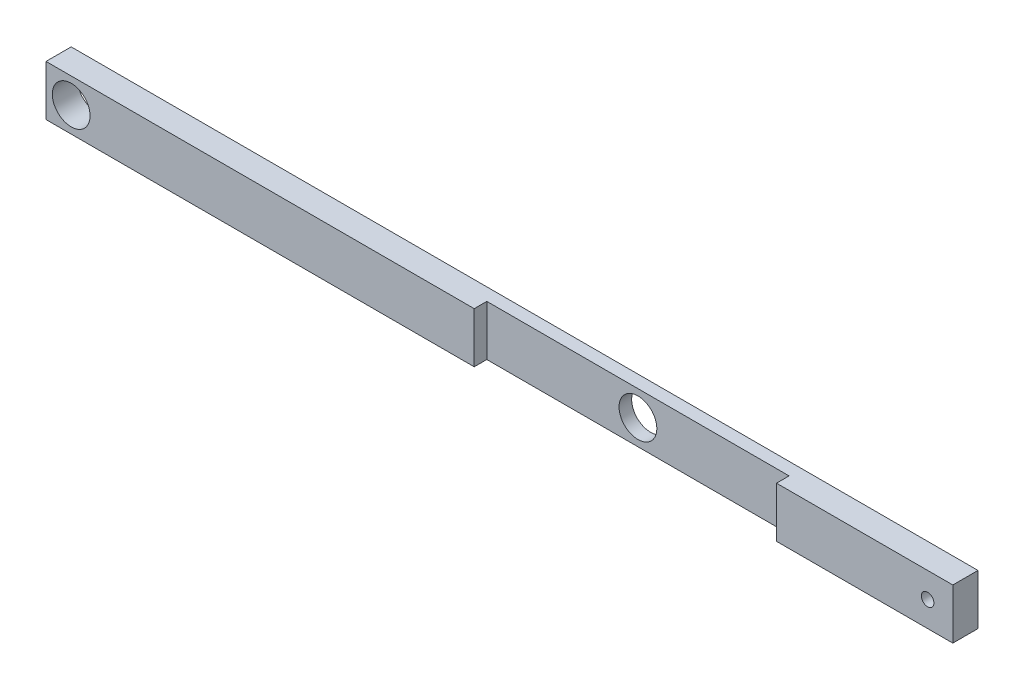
ISO-10303-21;
HEADER;
FILE_DESCRIPTION(('STEP AP214'),'2;1');
FILE_NAME('part.step','',(''),(''),'','','');
FILE_SCHEMA(('AUTOMOTIVE_DESIGN { 1 0 10303 214 1 1 1 1 }'));
ENDSEC;
DATA;
#1=APPLICATION_CONTEXT('core data for automotive mechanical design processes');
#2=APPLICATION_PROTOCOL_DEFINITION('international standard','automotive_design',2000,#1);
#3=PRODUCT_CONTEXT('',#1,'mechanical');
#4=PRODUCT('Part','Part','',(#3));
#5=PRODUCT_RELATED_PRODUCT_CATEGORY('part','',(#4));
#6=PRODUCT_DEFINITION_FORMATION('','',#4);
#7=PRODUCT_DEFINITION_CONTEXT('part definition',#1,'design');
#8=PRODUCT_DEFINITION('design','',#6,#7);
#9=PRODUCT_DEFINITION_SHAPE('','',#8);
#10=(LENGTH_UNIT() NAMED_UNIT(*) SI_UNIT(.MILLI.,.METRE.));
#11=(NAMED_UNIT(*) PLANE_ANGLE_UNIT() SI_UNIT($,.RADIAN.));
#12=(NAMED_UNIT(*) SI_UNIT($,.STERADIAN.) SOLID_ANGLE_UNIT());
#13=UNCERTAINTY_MEASURE_WITH_UNIT(LENGTH_MEASURE(1.E-05),#10,'distance_accuracy_value','');
#14=(GEOMETRIC_REPRESENTATION_CONTEXT(3) GLOBAL_UNCERTAINTY_ASSIGNED_CONTEXT((#13)) GLOBAL_UNIT_ASSIGNED_CONTEXT((#10,
#11,#12)) REPRESENTATION_CONTEXT('',''));
#15=CARTESIAN_POINT('',(0.,0.,0.));
#16=DIRECTION('',(0.,0.,1.));
#17=DIRECTION('',(1.,0.,0.));
#18=AXIS2_PLACEMENT_3D('',#15,#16,#17);
#19=CARTESIAN_POINT('',(0.,20.,10.));
#20=DIRECTION('',(0.,0.,-1.));
#21=DIRECTION('',(-1.,0.,0.));
#22=AXIS2_PLACEMENT_3D('',#19,#20,#21);
#23=PLANE('',#22);
#24=CARTESIAN_POINT('',(10.,10.,10.));
#25=DIRECTION('',(0.,0.,1.));
#26=DIRECTION('',(1.,0.,0.));
#27=AXIS2_PLACEMENT_3D('',#24,#25,#26);
#28=CIRCLE('',#27,7.5);
#29=CARTESIAN_POINT('',(17.5,10.,10.));
#30=VERTEX_POINT('',#29);
#31=EDGE_CURVE('E151',#30,#30,#28,.T.);
#32=ORIENTED_EDGE('',*,*,#31,.F.);
#33=EDGE_LOOP('',(#32));
#34=FACE_BOUND('',#33,.T.);
#35=DIRECTION('',(1.,0.,0.));
#36=VECTOR('',#35,1.);
#37=CARTESIAN_POINT('',(0.,0.,10.));
#38=LINE('',#37,#36);
#39=CARTESIAN_POINT('',(0.,0.,10.));
#40=VERTEX_POINT('',#39);
#41=CARTESIAN_POINT('',(170.,0.,10.));
#42=VERTEX_POINT('',#41);
#43=EDGE_CURVE('E87',#40,#42,#38,.T.);
#44=ORIENTED_EDGE('',*,*,#43,.T.);
#45=DIRECTION('',(0.,-1.,0.));
#46=VECTOR('',#45,1.);
#47=CARTESIAN_POINT('',(170.,0.,10.));
#48=LINE('',#47,#46);
#49=CARTESIAN_POINT('',(170.,20.,10.));
#50=VERTEX_POINT('',#49);
#51=EDGE_CURVE('E113',#50,#42,#48,.T.);
#52=ORIENTED_EDGE('',*,*,#51,.F.);
#53=DIRECTION('',(-1.,0.,0.));
#54=VECTOR('',#53,1.);
#55=CARTESIAN_POINT('',(0.,20.,10.));
#56=LINE('',#55,#54);
#57=CARTESIAN_POINT('',(0.,20.,10.));
#58=VERTEX_POINT('',#57);
#59=EDGE_CURVE('E58',#50,#58,#56,.T.);
#60=ORIENTED_EDGE('',*,*,#59,.T.);
#61=DIRECTION('',(0.,-1.,0.));
#62=VECTOR('',#61,1.);
#63=CARTESIAN_POINT('',(0.,0.,10.));
#64=LINE('',#63,#62);
#65=EDGE_CURVE('E158',#58,#40,#64,.T.);
#66=ORIENTED_EDGE('',*,*,#65,.T.);
#67=EDGE_LOOP('',(#44,#52,#60,#66));
#68=FACE_BOUND('',#67,.T.);
#69=ADVANCED_FACE('F33',(#34,#68),#23,.F.);
#70=CARTESIAN_POINT('',(0.,0.,10.));
#71=DIRECTION('',(1.,0.,0.));
#72=DIRECTION('',(0.,0.,-1.));
#73=AXIS2_PLACEMENT_3D('',#70,#71,#72);
#74=PLANE('',#73);
#75=DIRECTION('',(0.,-1.,0.));
#76=VECTOR('',#75,1.);
#77=CARTESIAN_POINT('',(0.,0.,0.));
#78=LINE('',#77,#76);
#79=CARTESIAN_POINT('',(0.,20.,0.));
#80=VERTEX_POINT('',#79);
#81=CARTESIAN_POINT('',(0.,0.,0.));
#82=VERTEX_POINT('',#81);
#83=EDGE_CURVE('E155',#80,#82,#78,.T.);
#84=ORIENTED_EDGE('',*,*,#83,.T.);
#85=DIRECTION('',(0.,0.,-1.));
#86=VECTOR('',#85,1.);
#87=CARTESIAN_POINT('',(0.,0.,10.));
#88=LINE('',#87,#86);
#89=EDGE_CURVE('E11',#40,#82,#88,.T.);
#90=ORIENTED_EDGE('',*,*,#89,.F.);
#91=ORIENTED_EDGE('',*,*,#65,.F.);
#92=DIRECTION('',(0.,0.,-1.));
#93=VECTOR('',#92,1.);
#94=CARTESIAN_POINT('',(0.,20.,10.));
#95=LINE('',#94,#93);
#96=EDGE_CURVE('E167',#58,#80,#95,.T.);
#97=ORIENTED_EDGE('',*,*,#96,.T.);
#98=EDGE_LOOP('',(#84,#90,#91,#97));
#99=FACE_BOUND('',#98,.T.);
#100=ADVANCED_FACE('F35',(#99),#74,.F.);
#101=CARTESIAN_POINT('',(0.,0.,10.));
#102=DIRECTION('',(0.,1.,0.));
#103=DIRECTION('',(0.,0.,1.));
#104=AXIS2_PLACEMENT_3D('',#101,#102,#103);
#105=PLANE('',#104);
#106=DIRECTION('',(1.,0.,0.));
#107=VECTOR('',#106,1.);
#108=CARTESIAN_POINT('',(170.,0.,5.));
#109=LINE('',#108,#107);
#110=CARTESIAN_POINT('',(170.,0.,5.));
#111=VERTEX_POINT('',#110);
#112=CARTESIAN_POINT('',(290.,0.,5.));
#113=VERTEX_POINT('',#112);
#114=EDGE_CURVE('E122',#111,#113,#109,.T.);
#115=ORIENTED_EDGE('',*,*,#114,.F.);
#116=DIRECTION('',(0.,0.,1.));
#117=VECTOR('',#116,1.);
#118=CARTESIAN_POINT('',(170.,0.,5.));
#119=LINE('',#118,#117);
#120=EDGE_CURVE('E108',#111,#42,#119,.T.);
#121=ORIENTED_EDGE('',*,*,#120,.T.);
#122=ORIENTED_EDGE('',*,*,#43,.F.);
#123=ORIENTED_EDGE('',*,*,#89,.T.);
#124=DIRECTION('',(1.,0.,0.));
#125=VECTOR('',#124,1.);
#126=CARTESIAN_POINT('',(0.,0.,0.));
#127=LINE('',#126,#125);
#128=CARTESIAN_POINT('',(360.,0.,0.));
#129=VERTEX_POINT('',#128);
#130=EDGE_CURVE('E170',#82,#129,#127,.T.);
#131=ORIENTED_EDGE('',*,*,#130,.T.);
#132=DIRECTION('',(0.,0.,-1.));
#133=VECTOR('',#132,1.);
#134=CARTESIAN_POINT('',(360.,0.,10.));
#135=LINE('',#134,#133);
#136=CARTESIAN_POINT('',(360.,0.,10.));
#137=VERTEX_POINT('',#136);
#138=EDGE_CURVE('E42',#137,#129,#135,.T.);
#139=ORIENTED_EDGE('',*,*,#138,.F.);
#140=CARTESIAN_POINT('',(290.,0.,10.));
#141=VERTEX_POINT('',#140);
#142=EDGE_CURVE('E160',#141,#137,#38,.T.);
#143=ORIENTED_EDGE('',*,*,#142,.F.);
#144=DIRECTION('',(0.,0.,1.));
#145=VECTOR('',#144,1.);
#146=CARTESIAN_POINT('',(290.,0.,5.));
#147=LINE('',#146,#145);
#148=EDGE_CURVE('E49',#113,#141,#147,.T.);
#149=ORIENTED_EDGE('',*,*,#148,.F.);
#150=EDGE_LOOP('',(#115,#121,#122,#123,#131,#139,#143,#149));
#151=FACE_BOUND('',#150,.T.);
#152=ADVANCED_FACE('F127',(#151),#105,.F.);
#153=CARTESIAN_POINT('',(360.,0.,10.));
#154=DIRECTION('',(-1.,0.,0.));
#155=DIRECTION('',(0.,0.,1.));
#156=AXIS2_PLACEMENT_3D('',#153,#154,#155);
#157=PLANE('',#156);
#158=DIRECTION('',(0.,1.,0.));
#159=VECTOR('',#158,1.);
#160=CARTESIAN_POINT('',(360.,0.,0.));
#161=LINE('',#160,#159);
#162=CARTESIAN_POINT('',(360.,20.,0.));
#163=VERTEX_POINT('',#162);
#164=EDGE_CURVE('E172',#129,#163,#161,.T.);
#165=ORIENTED_EDGE('',*,*,#164,.T.);
#166=DIRECTION('',(0.,0.,-1.));
#167=VECTOR('',#166,1.);
#168=CARTESIAN_POINT('',(360.,20.,10.));
#169=LINE('',#168,#167);
#170=CARTESIAN_POINT('',(360.,20.,10.));
#171=VERTEX_POINT('',#170);
#172=EDGE_CURVE('E176',#171,#163,#169,.T.);
#173=ORIENTED_EDGE('',*,*,#172,.F.);
#174=DIRECTION('',(0.,1.,0.));
#175=VECTOR('',#174,1.);
#176=CARTESIAN_POINT('',(360.,0.,10.));
#177=LINE('',#176,#175);
#178=EDGE_CURVE('E162',#137,#171,#177,.T.);
#179=ORIENTED_EDGE('',*,*,#178,.F.);
#180=ORIENTED_EDGE('',*,*,#138,.T.);
#181=EDGE_LOOP('',(#165,#173,#179,#180));
#182=FACE_BOUND('',#181,.T.);
#183=ADVANCED_FACE('F183',(#182),#157,.F.);
#184=CARTESIAN_POINT('',(0.,20.,10.));
#185=DIRECTION('',(0.,-1.,0.));
#186=DIRECTION('',(0.,0.,-1.));
#187=AXIS2_PLACEMENT_3D('',#184,#185,#186);
#188=PLANE('',#187);
#189=ORIENTED_EDGE('',*,*,#59,.F.);
#190=DIRECTION('',(0.,0.,1.));
#191=VECTOR('',#190,1.);
#192=CARTESIAN_POINT('',(170.,20.,5.));
#193=LINE('',#192,#191);
#194=CARTESIAN_POINT('',(170.,20.,5.));
#195=VERTEX_POINT('',#194);
#196=EDGE_CURVE('E136',#195,#50,#193,.T.);
#197=ORIENTED_EDGE('',*,*,#196,.F.);
#198=DIRECTION('',(-1.,0.,0.));
#199=VECTOR('',#198,1.);
#200=CARTESIAN_POINT('',(170.,20.,5.));
#201=LINE('',#200,#199);
#202=CARTESIAN_POINT('',(290.,20.,5.));
#203=VERTEX_POINT('',#202);
#204=EDGE_CURVE('E115',#203,#195,#201,.T.);
#205=ORIENTED_EDGE('',*,*,#204,.F.);
#206=DIRECTION('',(0.,0.,1.));
#207=VECTOR('',#206,1.);
#208=CARTESIAN_POINT('',(290.,20.,5.));
#209=LINE('',#208,#207);
#210=CARTESIAN_POINT('',(290.,20.,10.));
#211=VERTEX_POINT('',#210);
#212=EDGE_CURVE('E138',#203,#211,#209,.T.);
#213=ORIENTED_EDGE('',*,*,#212,.T.);
#214=EDGE_CURVE('E164',#171,#211,#56,.T.);
#215=ORIENTED_EDGE('',*,*,#214,.F.);
#216=ORIENTED_EDGE('',*,*,#172,.T.);
#217=DIRECTION('',(-1.,0.,0.));
#218=VECTOR('',#217,1.);
#219=CARTESIAN_POINT('',(0.,20.,0.));
#220=LINE('',#219,#218);
#221=EDGE_CURVE('E80',#163,#80,#220,.T.);
#222=ORIENTED_EDGE('',*,*,#221,.T.);
#223=ORIENTED_EDGE('',*,*,#96,.F.);
#224=EDGE_LOOP('',(#189,#197,#205,#213,#215,#216,#222,#223));
#225=FACE_BOUND('',#224,.T.);
#226=ADVANCED_FACE('F191',(#225),#188,.F.);
#227=CARTESIAN_POINT('',(350.,10.,10.));
#228=DIRECTION('',(0.,0.,1.));
#229=DIRECTION('',(1.,0.,0.));
#230=AXIS2_PLACEMENT_3D('',#227,#228,#229);
#231=CIRCLE('',#230,2.50000000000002);
#232=CARTESIAN_POINT('',(352.5,10.,10.));
#233=VERTEX_POINT('',#232);
#234=EDGE_CURVE('E146',#233,#233,#231,.T.);
#235=ORIENTED_EDGE('',*,*,#234,.F.);
#236=EDGE_LOOP('',(#235));
#237=FACE_BOUND('',#236,.T.);
#238=ORIENTED_EDGE('',*,*,#214,.T.);
#239=DIRECTION('',(0.,1.,0.));
#240=VECTOR('',#239,1.);
#241=CARTESIAN_POINT('',(290.,0.,10.));
#242=LINE('',#241,#240);
#243=EDGE_CURVE('E125',#141,#211,#242,.T.);
#244=ORIENTED_EDGE('',*,*,#243,.F.);
#245=ORIENTED_EDGE('',*,*,#142,.T.);
#246=ORIENTED_EDGE('',*,*,#178,.T.);
#247=EDGE_LOOP('',(#238,#244,#245,#246));
#248=FACE_BOUND('',#247,.T.);
#249=ADVANCED_FACE('F195',(#237,#248),#23,.F.);
#250=CARTESIAN_POINT('',(0.,20.,0.));
#251=DIRECTION('',(0.,0.,-1.));
#252=DIRECTION('',(-1.,0.,0.));
#253=AXIS2_PLACEMENT_3D('',#250,#251,#252);
#254=PLANE('',#253);
#255=CARTESIAN_POINT('',(350.,10.,0.));
#256=DIRECTION('',(0.,0.,1.));
#257=DIRECTION('',(1.,0.,0.));
#258=AXIS2_PLACEMENT_3D('',#255,#256,#257);
#259=CIRCLE('',#258,2.50000000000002);
#260=CARTESIAN_POINT('',(352.5,10.,0.));
#261=VERTEX_POINT('',#260);
#262=EDGE_CURVE('E142',#261,#261,#259,.T.);
#263=ORIENTED_EDGE('',*,*,#262,.T.);
#264=EDGE_LOOP('',(#263));
#265=FACE_BOUND('',#264,.T.);
#266=CARTESIAN_POINT('',(230.,10.,0.));
#267=DIRECTION('',(0.,0.,1.));
#268=DIRECTION('',(1.,0.,0.));
#269=AXIS2_PLACEMENT_3D('',#266,#267,#268);
#270=CIRCLE('',#269,7.50000000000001);
#271=CARTESIAN_POINT('',(237.5,10.,0.));
#272=VERTEX_POINT('',#271);
#273=EDGE_CURVE('E145',#272,#272,#270,.T.);
#274=ORIENTED_EDGE('',*,*,#273,.T.);
#275=EDGE_LOOP('',(#274));
#276=FACE_BOUND('',#275,.T.);
#277=CARTESIAN_POINT('',(10.,10.,0.));
#278=DIRECTION('',(0.,0.,1.));
#279=DIRECTION('',(1.,0.,0.));
#280=AXIS2_PLACEMENT_3D('',#277,#278,#279);
#281=CIRCLE('',#280,7.5);
#282=CARTESIAN_POINT('',(17.5,10.,0.));
#283=VERTEX_POINT('',#282);
#284=EDGE_CURVE('E152',#283,#283,#281,.T.);
#285=ORIENTED_EDGE('',*,*,#284,.T.);
#286=EDGE_LOOP('',(#285));
#287=FACE_BOUND('',#286,.T.);
#288=ORIENTED_EDGE('',*,*,#83,.F.);
#289=ORIENTED_EDGE('',*,*,#221,.F.);
#290=ORIENTED_EDGE('',*,*,#164,.F.);
#291=ORIENTED_EDGE('',*,*,#130,.F.);
#292=EDGE_LOOP('',(#288,#289,#290,#291));
#293=FACE_BOUND('',#292,.T.);
#294=ADVANCED_FACE('F187',(#265,#276,#287,#293),#254,.T.);
#295=CARTESIAN_POINT('',(10.,10.,0.));
#296=DIRECTION('',(0.,0.,1.));
#297=DIRECTION('',(1.,0.,0.));
#298=AXIS2_PLACEMENT_3D('',#295,#296,#297);
#299=CYLINDRICAL_SURFACE('',#298,7.5);
#300=ORIENTED_EDGE('',*,*,#284,.F.);
#301=EDGE_LOOP('',(#300));
#302=FACE_BOUND('',#301,.T.);
#303=ORIENTED_EDGE('',*,*,#31,.T.);
#304=EDGE_LOOP('',(#303));
#305=FACE_BOUND('',#304,.T.);
#306=ADVANCED_FACE('F208',(#302,#305),#299,.F.);
#307=CARTESIAN_POINT('',(230.,10.,0.));
#308=DIRECTION('',(0.,0.,1.));
#309=DIRECTION('',(1.,0.,0.));
#310=AXIS2_PLACEMENT_3D('',#307,#308,#309);
#311=CYLINDRICAL_SURFACE('',#310,7.50000000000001);
#312=CARTESIAN_POINT('',(230.,10.,5.));
#313=DIRECTION('',(0.,0.,-1.));
#314=DIRECTION('',(-1.,0.,0.));
#315=AXIS2_PLACEMENT_3D('',#312,#313,#314);
#316=CIRCLE('',#315,7.50000000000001);
#317=CARTESIAN_POINT('',(222.5,10.,5.));
#318=VERTEX_POINT('',#317);
#319=EDGE_CURVE('E37',#318,#318,#316,.F.);
#320=ORIENTED_EDGE('',*,*,#319,.T.);
#321=EDGE_LOOP('',(#320));
#322=FACE_BOUND('',#321,.T.);
#323=ORIENTED_EDGE('',*,*,#273,.F.);
#324=EDGE_LOOP('',(#323));
#325=FACE_BOUND('',#324,.T.);
#326=ADVANCED_FACE('F226',(#322,#325),#311,.F.);
#327=CARTESIAN_POINT('',(350.,10.,0.));
#328=DIRECTION('',(0.,0.,1.));
#329=DIRECTION('',(1.,0.,0.));
#330=AXIS2_PLACEMENT_3D('',#327,#328,#329);
#331=CYLINDRICAL_SURFACE('',#330,2.50000000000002);
#332=ORIENTED_EDGE('',*,*,#262,.F.);
#333=EDGE_LOOP('',(#332));
#334=FACE_BOUND('',#333,.T.);
#335=ORIENTED_EDGE('',*,*,#234,.T.);
#336=EDGE_LOOP('',(#335));
#337=FACE_BOUND('',#336,.T.);
#338=ADVANCED_FACE('F223',(#334,#337),#331,.F.);
#339=CARTESIAN_POINT('',(170.,20.,5.));
#340=DIRECTION('',(0.,0.,-1.));
#341=DIRECTION('',(-1.,0.,0.));
#342=AXIS2_PLACEMENT_3D('',#339,#340,#341);
#343=PLANE('',#342);
#344=DIRECTION('',(0.,-1.,0.));
#345=VECTOR('',#344,1.);
#346=CARTESIAN_POINT('',(170.,0.,5.));
#347=LINE('',#346,#345);
#348=EDGE_CURVE('E111',#195,#111,#347,.T.);
#349=ORIENTED_EDGE('',*,*,#348,.T.);
#350=ORIENTED_EDGE('',*,*,#114,.T.);
#351=DIRECTION('',(0.,1.,0.));
#352=VECTOR('',#351,1.);
#353=CARTESIAN_POINT('',(290.,0.,5.));
#354=LINE('',#353,#352);
#355=EDGE_CURVE('E129',#113,#203,#354,.T.);
#356=ORIENTED_EDGE('',*,*,#355,.T.);
#357=ORIENTED_EDGE('',*,*,#204,.T.);
#358=EDGE_LOOP('',(#349,#350,#356,#357));
#359=FACE_BOUND('',#358,.T.);
#360=ORIENTED_EDGE('',*,*,#319,.F.);
#361=EDGE_LOOP('',(#360));
#362=FACE_BOUND('',#361,.T.);
#363=ADVANCED_FACE('F119',(#359,#362),#343,.F.);
#364=CARTESIAN_POINT('',(170.,0.,5.));
#365=DIRECTION('',(-1.,0.,0.));
#366=DIRECTION('',(0.,0.,1.));
#367=AXIS2_PLACEMENT_3D('',#364,#365,#366);
#368=PLANE('',#367);
#369=ORIENTED_EDGE('',*,*,#51,.T.);
#370=ORIENTED_EDGE('',*,*,#120,.F.);
#371=ORIENTED_EDGE('',*,*,#348,.F.);
#372=ORIENTED_EDGE('',*,*,#196,.T.);
#373=EDGE_LOOP('',(#369,#370,#371,#372));
#374=FACE_BOUND('',#373,.T.);
#375=ADVANCED_FACE('F110',(#374),#368,.F.);
#376=CARTESIAN_POINT('',(290.,0.,5.));
#377=DIRECTION('',(1.,0.,0.));
#378=DIRECTION('',(0.,0.,-1.));
#379=AXIS2_PLACEMENT_3D('',#376,#377,#378);
#380=PLANE('',#379);
#381=ORIENTED_EDGE('',*,*,#243,.T.);
#382=ORIENTED_EDGE('',*,*,#212,.F.);
#383=ORIENTED_EDGE('',*,*,#355,.F.);
#384=ORIENTED_EDGE('',*,*,#148,.T.);
#385=EDGE_LOOP('',(#381,#382,#383,#384));
#386=FACE_BOUND('',#385,.T.);
#387=ADVANCED_FACE('F214',(#386),#380,.F.);
#388=CLOSED_SHELL('',(#69,#100,#152,#183,#226,#249,#294,#306,#326,#338,#363,#375,#387));
#389=MANIFOLD_SOLID_BREP('B2',#388);
#390=ADVANCED_BREP_SHAPE_REPRESENTATION('',(#18,#389),#14);
#391=SHAPE_DEFINITION_REPRESENTATION(#9,#390);
ENDSEC;
END-ISO-10303-21;
